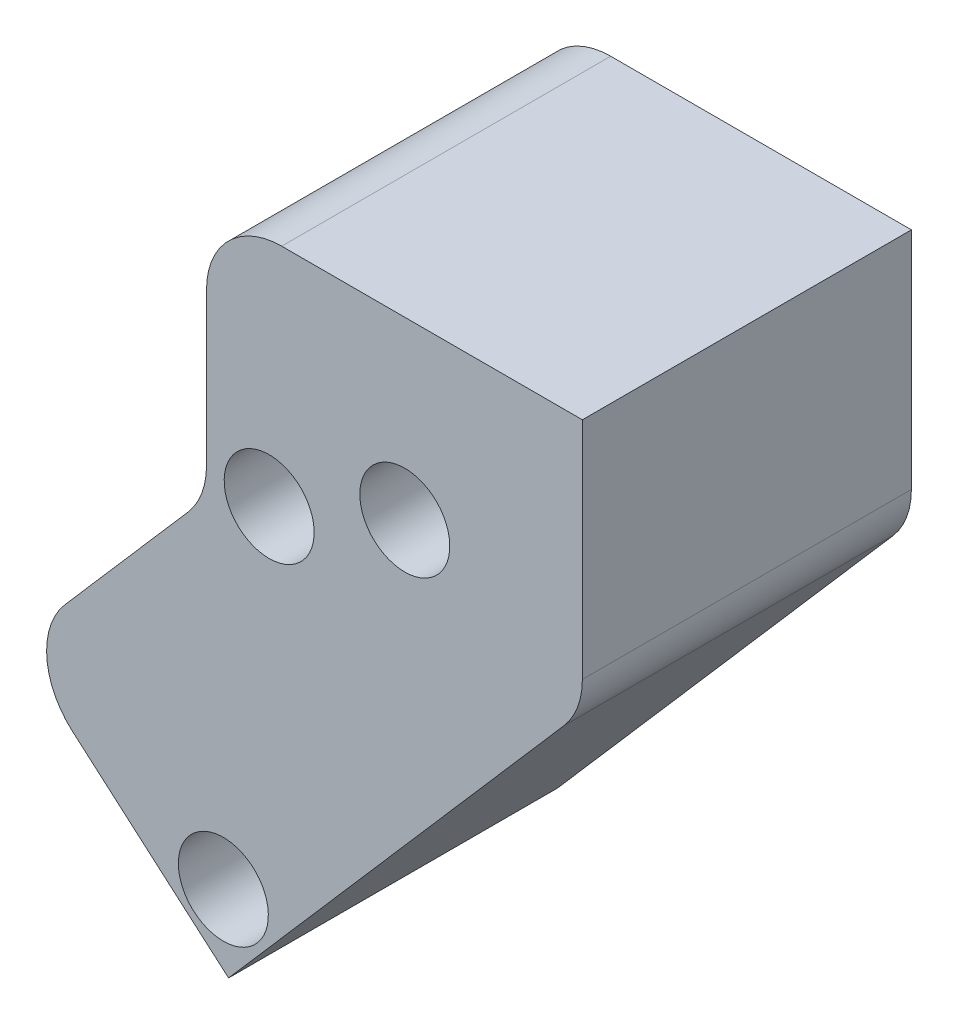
ISO-10303-21;
HEADER;
FILE_DESCRIPTION(('STEP AP214'),'2;1');
FILE_NAME('part.step','',(''),(''),'','','');
FILE_SCHEMA(('AUTOMOTIVE_DESIGN { 1 0 10303 214 1 1 1 1 }'));
ENDSEC;
DATA;
#1=APPLICATION_CONTEXT('core data for automotive mechanical design processes');
#2=APPLICATION_PROTOCOL_DEFINITION('international standard','automotive_design',2000,#1);
#3=PRODUCT_CONTEXT('',#1,'mechanical');
#4=PRODUCT('Part','Part','',(#3));
#5=PRODUCT_RELATED_PRODUCT_CATEGORY('part','',(#4));
#6=PRODUCT_DEFINITION_FORMATION('','',#4);
#7=PRODUCT_DEFINITION_CONTEXT('part definition',#1,'design');
#8=PRODUCT_DEFINITION('design','',#6,#7);
#9=PRODUCT_DEFINITION_SHAPE('','',#8);
#10=(LENGTH_UNIT() NAMED_UNIT(*) SI_UNIT(.MILLI.,.METRE.));
#11=(NAMED_UNIT(*) PLANE_ANGLE_UNIT() SI_UNIT($,.RADIAN.));
#12=(NAMED_UNIT(*) SI_UNIT($,.STERADIAN.) SOLID_ANGLE_UNIT());
#13=UNCERTAINTY_MEASURE_WITH_UNIT(LENGTH_MEASURE(1.E-05),#10,'distance_accuracy_value','');
#14=(GEOMETRIC_REPRESENTATION_CONTEXT(3) GLOBAL_UNCERTAINTY_ASSIGNED_CONTEXT((#13)) GLOBAL_UNIT_ASSIGNED_CONTEXT((#10,
#11,#12)) REPRESENTATION_CONTEXT('',''));
#15=CARTESIAN_POINT('',(0.,0.,0.));
#16=DIRECTION('',(0.,0.,1.));
#17=DIRECTION('',(1.,0.,0.));
#18=AXIS2_PLACEMENT_3D('',#15,#16,#17);
#19=CARTESIAN_POINT('',(-2.53446297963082E-11,8.21987336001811E-12,1.59986189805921));
#20=DIRECTION('',(1.58417609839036E-11,-5.13786431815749E-12,-1.));
#21=DIRECTION('',(-1.,0.,-1.58417609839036E-11));
#22=AXIS2_PLACEMENT_3D('',#19,#20,#21);
#23=PLANE('',#22);
#24=CARTESIAN_POINT('',(-695.325000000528,-36.6948728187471,1.59986188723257));
#25=DIRECTION('',(0.,5.13786431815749E-12,1.));
#26=DIRECTION('',(0.,-1.,5.13786431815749E-12));
#27=AXIS2_PLACEMENT_3D('',#24,#25,#26);
#28=CIRCLE('',#27,4.55930000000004);
#29=CARTESIAN_POINT('',(-695.325000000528,-41.2541728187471,1.59986188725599));
#30=VERTEX_POINT('',#29);
#31=EDGE_CURVE('E299',#30,#30,#28,.T.);
#32=ORIENTED_EDGE('',*,*,#31,.F.);
#33=EDGE_LOOP('',(#32));
#34=FACE_BOUND('',#33,.T.);
#35=CARTESIAN_POINT('',(-681.576795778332,-31.0085922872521,1.59986188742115));
#36=DIRECTION('',(0.,5.13786431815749E-12,1.));
#37=DIRECTION('',(0.,-1.,5.13786431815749E-12));
#38=AXIS2_PLACEMENT_3D('',#35,#36,#37);
#39=CIRCLE('',#38,4.55930000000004);
#40=CARTESIAN_POINT('',(-681.576795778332,-35.5678922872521,1.59986188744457));
#41=VERTEX_POINT('',#40);
#42=EDGE_CURVE('E283',#41,#41,#39,.T.);
#43=ORIENTED_EDGE('',*,*,#42,.F.);
#44=EDGE_LOOP('',(#43));
#45=FACE_BOUND('',#44,.T.);
#46=CARTESIAN_POINT('',(-699.969677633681,-72.610364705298,1.59986188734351));
#47=DIRECTION('',(0.,5.13786431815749E-12,1.));
#48=DIRECTION('',(0.,-1.,5.13786431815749E-12));
#49=AXIS2_PLACEMENT_3D('',#46,#47,#48);
#50=CIRCLE('',#49,4.55930000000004);
#51=CARTESIAN_POINT('',(-699.969677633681,-77.169664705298,1.59986188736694));
#52=VERTEX_POINT('',#51);
#53=EDGE_CURVE('E267',#52,#52,#50,.T.);
#54=ORIENTED_EDGE('',*,*,#53,.F.);
#55=EDGE_LOOP('',(#54));
#56=FACE_BOUND('',#55,.T.);
#57=DIRECTION('',(1.,0.,1.58417609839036E-11));
#58=VECTOR('',#57,1.);
#59=CARTESIAN_POINT('',(-663.574999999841,-13.1998728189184,1.59986188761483));
#60=LINE('',#59,#58);
#61=CARTESIAN_POINT('',(-694.055,-13.1998728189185,1.59986188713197));
#62=VERTEX_POINT('',#61);
#63=CARTESIAN_POINT('',(-663.575,-13.1998728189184,1.59986188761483));
#64=VERTEX_POINT('',#63);
#65=EDGE_CURVE('E124',#62,#64,#60,.T.);
#66=ORIENTED_EDGE('',*,*,#65,.F.);
#67=CARTESIAN_POINT('',(-694.055,-20.8198728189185,1.59986188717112));
#68=DIRECTION('',(1.58417609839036E-11,-5.13786431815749E-12,-1.));
#69=DIRECTION('',(-1.,0.,-1.58417609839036E-11));
#70=AXIS2_PLACEMENT_3D('',#67,#68,#69);
#71=CIRCLE('',#70,7.61999999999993);
#72=CARTESIAN_POINT('',(-701.675,-20.8198728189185,1.59986188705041));
#73=VERTEX_POINT('',#72);
#74=EDGE_CURVE('E131',#73,#62,#71,.T.);
#75=ORIENTED_EDGE('',*,*,#74,.F.);
#76=DIRECTION('',(0.,1.,-5.13786431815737E-12));
#77=VECTOR('',#76,1.);
#78=CARTESIAN_POINT('',(-701.675,-20.8198728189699,1.59986188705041));
#79=LINE('',#78,#77);
#80=CARTESIAN_POINT('',(-701.675,-36.2820751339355,1.59986188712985));
#81=VERTEX_POINT('',#80);
#82=EDGE_CURVE('E248',#81,#73,#79,.T.);
#83=ORIENTED_EDGE('',*,*,#82,.F.);
#84=CARTESIAN_POINT('',(-709.295,-36.2820751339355,1.59986188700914));
#85=DIRECTION('',(1.58417609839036E-11,-5.13786431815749E-12,-1.));
#86=DIRECTION('',(-1.,0.,-1.58417609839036E-11));
#87=AXIS2_PLACEMENT_3D('',#84,#85,#86);
#88=CIRCLE('',#87,7.61999999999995);
#89=CARTESIAN_POINT('',(-703.541670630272,-41.2784339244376,1.59986188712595));
#90=VERTEX_POINT('',#89);
#91=EDGE_CURVE('E244',#90,#81,#88,.F.);
#92=ORIENTED_EDGE('',*,*,#91,.F.);
#93=DIRECTION('',(0.65569012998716,0.75503010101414,6.50804410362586E-12));
#94=VECTOR('',#93,1.);
#95=CARTESIAN_POINT('',(-703.54167063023,-41.2784339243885,1.59986188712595));
#96=LINE('',#95,#94);
#97=CARTESIAN_POINT('',(-716.018424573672,-55.6454715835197,1.59986188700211));
#98=VERTEX_POINT('',#97);
#99=EDGE_CURVE('E239',#98,#90,#96,.T.);
#100=ORIENTED_EDGE('',*,*,#99,.F.);
#101=CARTESIAN_POINT('',(-710.265095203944,-60.6418303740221,1.59986188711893));
#102=DIRECTION('',(1.58417609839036E-11,-5.13786431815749E-12,-1.));
#103=DIRECTION('',(-1.,0.,-1.58417609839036E-11));
#104=AXIS2_PLACEMENT_3D('',#101,#102,#103);
#105=CIRCLE('',#104,7.62000000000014);
#106=CARTESIAN_POINT('',(-715.261453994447,-66.3951597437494,1.59986188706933));
#107=VERTEX_POINT('',#106);
#108=EDGE_CURVE('E258',#107,#98,#105,.T.);
#109=ORIENTED_EDGE('',*,*,#108,.F.);
#110=DIRECTION('',(-0.75503010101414,0.65569012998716,-1.53298533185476E-11));
#111=VECTOR('',#110,1.);
#112=CARTESIAN_POINT('',(-715.261453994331,-66.39515974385,1.59986188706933));
#113=LINE('',#112,#111);
#114=CARTESIAN_POINT('',(-699.439798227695,-80.1351464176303,1.59986188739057));
#115=VERTEX_POINT('',#114);
#116=EDGE_CURVE('E229',#115,#107,#113,.T.);
#117=ORIENTED_EDGE('',*,*,#116,.F.);
#118=DIRECTION('',(-0.65569012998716,-0.75503010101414,-6.50804410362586E-12));
#119=VECTOR('',#118,1.);
#120=CARTESIAN_POINT('',(-665.441670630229,-40.9861512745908,1.59986188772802));
#121=LINE('',#120,#119);
#122=CARTESIAN_POINT('',(-665.441670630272,-40.9861512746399,1.59986188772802));
#123=VERTEX_POINT('',#122);
#124=EDGE_CURVE('E224',#123,#115,#121,.T.);
#125=ORIENTED_EDGE('',*,*,#124,.F.);
#126=CARTESIAN_POINT('',(-671.195,-35.989792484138,1.59986188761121));
#127=DIRECTION('',(1.58417609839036E-11,-5.13786431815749E-12,-1.));
#128=DIRECTION('',(-1.,0.,-1.58417609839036E-11));
#129=AXIS2_PLACEMENT_3D('',#126,#127,#128);
#130=CIRCLE('',#129,7.61999999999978);
#131=CARTESIAN_POINT('',(-663.575,-35.989792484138,1.59986188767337));
#132=VERTEX_POINT('',#131);
#133=EDGE_CURVE('E64',#132,#123,#130,.T.);
#134=ORIENTED_EDGE('',*,*,#133,.F.);
#135=DIRECTION('',(0.,-1.,5.13786431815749E-12));
#136=VECTOR('',#135,1.);
#137=CARTESIAN_POINT('',(-663.575,-13.1998728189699,1.59986188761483));
#138=LINE('',#137,#136);
#139=EDGE_CURVE('E12',#64,#132,#138,.T.);
#140=ORIENTED_EDGE('',*,*,#139,.F.);
#141=EDGE_LOOP('',(#66,#75,#83,#92,#100,#109,#117,#125,#134,#140));
#142=FACE_BOUND('',#141,.T.);
#143=ADVANCED_FACE('F48',(#34,#45,#56,#142),#23,.F.);
#144=CARTESIAN_POINT('',(-663.575,-13.1998728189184,11.6078));
#145=DIRECTION('',(0.,-1.,0.));
#146=DIRECTION('',(1.,0.,0.));
#147=AXIS2_PLACEMENT_3D('',#144,#145,#146);
#148=PLANE('',#147);
#149=DIRECTION('',(0.,0.,-1.));
#150=VECTOR('',#149,1.);
#151=CARTESIAN_POINT('',(-694.055,-13.1998728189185,11.6078));
#152=LINE('',#151,#150);
#153=CARTESIAN_POINT('',(-694.055,-13.1998728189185,-31.75));
#154=VERTEX_POINT('',#153);
#155=EDGE_CURVE('E57',#62,#154,#152,.T.);
#156=ORIENTED_EDGE('',*,*,#155,.F.);
#157=ORIENTED_EDGE('',*,*,#65,.T.);
#158=DIRECTION('',(0.,0.,-1.));
#159=VECTOR('',#158,1.);
#160=CARTESIAN_POINT('',(-663.575,-13.1998728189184,11.6078));
#161=LINE('',#160,#159);
#162=CARTESIAN_POINT('',(-663.575,-13.1998728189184,-31.75));
#163=VERTEX_POINT('',#162);
#164=EDGE_CURVE('E71',#64,#163,#161,.T.);
#165=ORIENTED_EDGE('',*,*,#164,.T.);
#166=DIRECTION('',(-1.,0.,0.));
#167=VECTOR('',#166,1.);
#168=CARTESIAN_POINT('',(-663.575,-13.1998728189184,-31.75));
#169=LINE('',#168,#167);
#170=EDGE_CURVE('E130',#163,#154,#169,.T.);
#171=ORIENTED_EDGE('',*,*,#170,.T.);
#172=EDGE_LOOP('',(#156,#157,#165,#171));
#173=FACE_BOUND('',#172,.T.);
#174=ADVANCED_FACE('F50',(#173),#148,.F.);
#175=CARTESIAN_POINT('',(-694.055,-20.8198728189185,11.6078));
#176=DIRECTION('',(0.,0.,-1.));
#177=DIRECTION('',(-1.,0.,0.));
#178=AXIS2_PLACEMENT_3D('',#175,#176,#177);
#179=CYLINDRICAL_SURFACE('',#178,7.61999999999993);
#180=DIRECTION('',(0.,0.,-1.));
#181=VECTOR('',#180,1.);
#182=CARTESIAN_POINT('',(-701.675,-20.8198728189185,11.6078));
#183=LINE('',#182,#181);
#184=CARTESIAN_POINT('',(-701.675,-20.8198728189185,-31.75));
#185=VERTEX_POINT('',#184);
#186=EDGE_CURVE('E166',#73,#185,#183,.T.);
#187=ORIENTED_EDGE('',*,*,#186,.F.);
#188=ORIENTED_EDGE('',*,*,#74,.T.);
#189=ORIENTED_EDGE('',*,*,#155,.T.);
#190=CARTESIAN_POINT('',(-694.055,-20.8198728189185,-31.75));
#191=DIRECTION('',(0.,0.,1.));
#192=DIRECTION('',(1.,0.,0.));
#193=AXIS2_PLACEMENT_3D('',#190,#191,#192);
#194=CIRCLE('',#193,7.61999999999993);
#195=EDGE_CURVE('E175',#154,#185,#194,.T.);
#196=ORIENTED_EDGE('',*,*,#195,.T.);
#197=EDGE_LOOP('',(#187,#188,#189,#196));
#198=FACE_BOUND('',#197,.T.);
#199=ADVANCED_FACE('F174',(#198),#179,.T.);
#200=CARTESIAN_POINT('',(-701.675,-20.8198728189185,11.6078));
#201=DIRECTION('',(1.,0.,0.));
#202=DIRECTION('',(0.,1.,0.));
#203=AXIS2_PLACEMENT_3D('',#200,#201,#202);
#204=PLANE('',#203);
#205=DIRECTION('',(0.,0.,-1.));
#206=VECTOR('',#205,1.);
#207=CARTESIAN_POINT('',(-701.675,-36.2820751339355,11.6078));
#208=LINE('',#207,#206);
#209=CARTESIAN_POINT('',(-701.675,-36.2820751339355,-31.75));
#210=VERTEX_POINT('',#209);
#211=EDGE_CURVE('E163',#81,#210,#208,.T.);
#212=ORIENTED_EDGE('',*,*,#211,.F.);
#213=ORIENTED_EDGE('',*,*,#82,.T.);
#214=ORIENTED_EDGE('',*,*,#186,.T.);
#215=DIRECTION('',(0.,-1.,0.));
#216=VECTOR('',#215,1.);
#217=CARTESIAN_POINT('',(-701.675,-20.8198728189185,-31.75));
#218=LINE('',#217,#216);
#219=EDGE_CURVE('E181',#185,#210,#218,.T.);
#220=ORIENTED_EDGE('',*,*,#219,.T.);
#221=EDGE_LOOP('',(#212,#213,#214,#220));
#222=FACE_BOUND('',#221,.T.);
#223=ADVANCED_FACE('F247',(#222),#204,.F.);
#224=CARTESIAN_POINT('',(-709.295,-36.2820751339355,11.6078));
#225=DIRECTION('',(0.,0.,-1.));
#226=DIRECTION('',(-1.,0.,0.));
#227=AXIS2_PLACEMENT_3D('',#224,#225,#226);
#228=CYLINDRICAL_SURFACE('',#227,7.61999999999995);
#229=DIRECTION('',(0.,0.,-1.));
#230=VECTOR('',#229,1.);
#231=CARTESIAN_POINT('',(-703.541670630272,-41.2784339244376,11.6078));
#232=LINE('',#231,#230);
#233=CARTESIAN_POINT('',(-703.541670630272,-41.2784339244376,-31.75));
#234=VERTEX_POINT('',#233);
#235=EDGE_CURVE('E160',#90,#234,#232,.T.);
#236=ORIENTED_EDGE('',*,*,#235,.F.);
#237=ORIENTED_EDGE('',*,*,#91,.T.);
#238=ORIENTED_EDGE('',*,*,#211,.T.);
#239=CARTESIAN_POINT('',(-709.295,-36.2820751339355,-31.75));
#240=DIRECTION('',(0.,0.,-1.));
#241=DIRECTION('',(-1.,0.,0.));
#242=AXIS2_PLACEMENT_3D('',#239,#240,#241);
#243=CIRCLE('',#242,7.61999999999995);
#244=EDGE_CURVE('E191',#210,#234,#243,.T.);
#245=ORIENTED_EDGE('',*,*,#244,.T.);
#246=EDGE_LOOP('',(#236,#237,#238,#245));
#247=FACE_BOUND('',#246,.T.);
#248=ADVANCED_FACE('F242',(#247),#228,.F.);
#249=CARTESIAN_POINT('',(-703.541670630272,-41.2784339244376,11.6078));
#250=DIRECTION('',(0.75503010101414,-0.655690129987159,0.));
#251=DIRECTION('',(0.65569012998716,0.75503010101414,0.));
#252=AXIS2_PLACEMENT_3D('',#249,#250,#251);
#253=PLANE('',#252);
#254=DIRECTION('',(0.,0.,-1.));
#255=VECTOR('',#254,1.);
#256=CARTESIAN_POINT('',(-716.018424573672,-55.6454715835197,11.6078));
#257=LINE('',#256,#255);
#258=CARTESIAN_POINT('',(-716.018424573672,-55.6454715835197,-31.75));
#259=VERTEX_POINT('',#258);
#260=EDGE_CURVE('E157',#98,#259,#257,.T.);
#261=ORIENTED_EDGE('',*,*,#260,.F.);
#262=ORIENTED_EDGE('',*,*,#99,.T.);
#263=ORIENTED_EDGE('',*,*,#235,.T.);
#264=DIRECTION('',(-0.655690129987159,-0.75503010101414,0.));
#265=VECTOR('',#264,1.);
#266=CARTESIAN_POINT('',(-703.541670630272,-41.2784339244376,-31.75));
#267=LINE('',#266,#265);
#268=EDGE_CURVE('E195',#234,#259,#267,.T.);
#269=ORIENTED_EDGE('',*,*,#268,.T.);
#270=EDGE_LOOP('',(#261,#262,#263,#269));
#271=FACE_BOUND('',#270,.T.);
#272=ADVANCED_FACE('F236',(#271),#253,.F.);
#273=CARTESIAN_POINT('',(-710.265095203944,-60.6418303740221,11.6078));
#274=DIRECTION('',(0.,0.,-1.));
#275=DIRECTION('',(-1.,0.,0.));
#276=AXIS2_PLACEMENT_3D('',#273,#274,#275);
#277=CYLINDRICAL_SURFACE('',#276,7.62000000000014);
#278=DIRECTION('',(0.,0.,-1.));
#279=VECTOR('',#278,1.);
#280=CARTESIAN_POINT('',(-715.261453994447,-66.3951597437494,11.6078));
#281=LINE('',#280,#279);
#282=CARTESIAN_POINT('',(-715.261453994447,-66.3951597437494,-31.75));
#283=VERTEX_POINT('',#282);
#284=EDGE_CURVE('E154',#107,#283,#281,.T.);
#285=ORIENTED_EDGE('',*,*,#284,.F.);
#286=ORIENTED_EDGE('',*,*,#108,.T.);
#287=ORIENTED_EDGE('',*,*,#260,.T.);
#288=CARTESIAN_POINT('',(-710.265095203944,-60.6418303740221,-31.75));
#289=DIRECTION('',(0.,0.,1.));
#290=DIRECTION('',(-1.,0.,0.));
#291=AXIS2_PLACEMENT_3D('',#288,#289,#290);
#292=CIRCLE('',#291,7.62000000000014);
#293=EDGE_CURVE('E199',#259,#283,#292,.T.);
#294=ORIENTED_EDGE('',*,*,#293,.T.);
#295=EDGE_LOOP('',(#285,#286,#287,#294));
#296=FACE_BOUND('',#295,.T.);
#297=ADVANCED_FACE('F232',(#296),#277,.T.);
#298=CARTESIAN_POINT('',(-715.261453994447,-66.3951597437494,11.6078));
#299=DIRECTION('',(0.655690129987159,0.75503010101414,0.));
#300=DIRECTION('',(-0.75503010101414,0.65569012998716,0.));
#301=AXIS2_PLACEMENT_3D('',#298,#299,#300);
#302=PLANE('',#301);
#303=DIRECTION('',(0.,0.,-1.));
#304=VECTOR('',#303,1.);
#305=CARTESIAN_POINT('',(-699.439798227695,-80.1351464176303,11.6078));
#306=LINE('',#305,#304);
#307=CARTESIAN_POINT('',(-699.439798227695,-80.1351464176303,-31.75));
#308=VERTEX_POINT('',#307);
#309=EDGE_CURVE('E151',#115,#308,#306,.T.);
#310=ORIENTED_EDGE('',*,*,#309,.F.);
#311=ORIENTED_EDGE('',*,*,#116,.T.);
#312=ORIENTED_EDGE('',*,*,#284,.T.);
#313=DIRECTION('',(0.75503010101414,-0.655690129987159,0.));
#314=VECTOR('',#313,1.);
#315=CARTESIAN_POINT('',(-715.261453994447,-66.3951597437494,-31.75));
#316=LINE('',#315,#314);
#317=EDGE_CURVE('E203',#283,#308,#316,.T.);
#318=ORIENTED_EDGE('',*,*,#317,.T.);
#319=EDGE_LOOP('',(#310,#311,#312,#318));
#320=FACE_BOUND('',#319,.T.);
#321=ADVANCED_FACE('F227',(#320),#302,.F.);
#322=CARTESIAN_POINT('',(-665.441670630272,-40.98615127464,11.6078));
#323=DIRECTION('',(-0.755030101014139,0.65569012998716,0.));
#324=DIRECTION('',(-0.65569012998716,-0.75503010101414,0.));
#325=AXIS2_PLACEMENT_3D('',#322,#323,#324);
#326=PLANE('',#325);
#327=DIRECTION('',(0.,0.,-1.));
#328=VECTOR('',#327,1.);
#329=CARTESIAN_POINT('',(-665.441670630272,-40.98615127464,11.6078));
#330=LINE('',#329,#328);
#331=CARTESIAN_POINT('',(-665.441670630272,-40.98615127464,-31.75));
#332=VERTEX_POINT('',#331);
#333=EDGE_CURVE('E143',#123,#332,#330,.T.);
#334=ORIENTED_EDGE('',*,*,#333,.F.);
#335=ORIENTED_EDGE('',*,*,#124,.T.);
#336=ORIENTED_EDGE('',*,*,#309,.T.);
#337=DIRECTION('',(0.65569012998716,0.755030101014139,0.));
#338=VECTOR('',#337,1.);
#339=CARTESIAN_POINT('',(-665.441670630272,-40.98615127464,-31.75));
#340=LINE('',#339,#338);
#341=EDGE_CURVE('E207',#308,#332,#340,.T.);
#342=ORIENTED_EDGE('',*,*,#341,.T.);
#343=EDGE_LOOP('',(#334,#335,#336,#342));
#344=FACE_BOUND('',#343,.T.);
#345=ADVANCED_FACE('F221',(#344),#326,.F.);
#346=CARTESIAN_POINT('',(-671.195,-35.989792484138,11.6078));
#347=DIRECTION('',(0.,0.,-1.));
#348=DIRECTION('',(-1.,0.,0.));
#349=AXIS2_PLACEMENT_3D('',#346,#347,#348);
#350=CYLINDRICAL_SURFACE('',#349,7.61999999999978);
#351=DIRECTION('',(0.,0.,-1.));
#352=VECTOR('',#351,1.);
#353=CARTESIAN_POINT('',(-663.575,-35.989792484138,11.6078));
#354=LINE('',#353,#352);
#355=CARTESIAN_POINT('',(-663.575,-35.989792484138,-31.75));
#356=VERTEX_POINT('',#355);
#357=EDGE_CURVE('E138',#132,#356,#354,.T.);
#358=ORIENTED_EDGE('',*,*,#357,.F.);
#359=ORIENTED_EDGE('',*,*,#133,.T.);
#360=ORIENTED_EDGE('',*,*,#333,.T.);
#361=CARTESIAN_POINT('',(-671.195,-35.989792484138,-31.75));
#362=DIRECTION('',(0.,0.,1.));
#363=DIRECTION('',(1.,0.,0.));
#364=AXIS2_PLACEMENT_3D('',#361,#362,#363);
#365=CIRCLE('',#364,7.61999999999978);
#366=EDGE_CURVE('E145',#332,#356,#365,.T.);
#367=ORIENTED_EDGE('',*,*,#366,.T.);
#368=EDGE_LOOP('',(#358,#359,#360,#367));
#369=FACE_BOUND('',#368,.T.);
#370=ADVANCED_FACE('F215',(#369),#350,.T.);
#371=CARTESIAN_POINT('',(-663.575,-13.1998728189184,11.6078));
#372=DIRECTION('',(-1.,0.,0.));
#373=DIRECTION('',(0.,0.,1.));
#374=AXIS2_PLACEMENT_3D('',#371,#372,#373);
#375=PLANE('',#374);
#376=ORIENTED_EDGE('',*,*,#164,.F.);
#377=ORIENTED_EDGE('',*,*,#139,.T.);
#378=ORIENTED_EDGE('',*,*,#357,.T.);
#379=DIRECTION('',(0.,1.,0.));
#380=VECTOR('',#379,1.);
#381=CARTESIAN_POINT('',(-663.575,-13.1998728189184,-31.75));
#382=LINE('',#381,#380);
#383=EDGE_CURVE('E135',#356,#163,#382,.T.);
#384=ORIENTED_EDGE('',*,*,#383,.T.);
#385=EDGE_LOOP('',(#376,#377,#378,#384));
#386=FACE_BOUND('',#385,.T.);
#387=ADVANCED_FACE('F133',(#386),#375,.F.);
#388=CARTESIAN_POINT('',(-694.055,-20.8198728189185,-31.75));
#389=DIRECTION('',(0.,0.,1.));
#390=DIRECTION('',(1.,0.,0.));
#391=AXIS2_PLACEMENT_3D('',#388,#389,#390);
#392=PLANE('',#391);
#393=CARTESIAN_POINT('',(-695.325000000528,-36.6948728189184,-31.7500000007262));
#394=DIRECTION('',(0.,5.13786431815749E-12,1.));
#395=DIRECTION('',(0.,-1.,5.13786431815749E-12));
#396=AXIS2_PLACEMENT_3D('',#393,#394,#395);
#397=CIRCLE('',#396,2.80669999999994);
#398=CARTESIAN_POINT('',(-695.325000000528,-39.5015728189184,-31.7500000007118));
#399=VERTEX_POINT('',#398);
#400=EDGE_CURVE('E311',#399,#399,#397,.T.);
#401=ORIENTED_EDGE('',*,*,#400,.T.);
#402=EDGE_LOOP('',(#401));
#403=FACE_BOUND('',#402,.T.);
#404=CARTESIAN_POINT('',(-681.576795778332,-31.0085922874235,-31.7500000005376));
#405=DIRECTION('',(0.,5.13786431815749E-12,1.));
#406=DIRECTION('',(0.,-1.,5.13786431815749E-12));
#407=AXIS2_PLACEMENT_3D('',#404,#405,#406);
#408=CIRCLE('',#407,2.80669999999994);
#409=CARTESIAN_POINT('',(-681.576795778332,-33.8152922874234,-31.7500000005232));
#410=VERTEX_POINT('',#409);
#411=EDGE_CURVE('E295',#410,#410,#408,.T.);
#412=ORIENTED_EDGE('',*,*,#411,.T.);
#413=EDGE_LOOP('',(#412));
#414=FACE_BOUND('',#413,.T.);
#415=CARTESIAN_POINT('',(-699.969677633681,-72.6103647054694,-31.7500000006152));
#416=DIRECTION('',(0.,5.13786431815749E-12,1.));
#417=DIRECTION('',(0.,-1.,5.13786431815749E-12));
#418=AXIS2_PLACEMENT_3D('',#415,#416,#417);
#419=CIRCLE('',#418,2.80669999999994);
#420=CARTESIAN_POINT('',(-699.969677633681,-75.4170647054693,-31.7500000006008));
#421=VERTEX_POINT('',#420);
#422=EDGE_CURVE('E279',#421,#421,#419,.T.);
#423=ORIENTED_EDGE('',*,*,#422,.T.);
#424=EDGE_LOOP('',(#423));
#425=FACE_BOUND('',#424,.T.);
#426=ORIENTED_EDGE('',*,*,#170,.F.);
#427=ORIENTED_EDGE('',*,*,#383,.F.);
#428=ORIENTED_EDGE('',*,*,#366,.F.);
#429=ORIENTED_EDGE('',*,*,#341,.F.);
#430=ORIENTED_EDGE('',*,*,#317,.F.);
#431=ORIENTED_EDGE('',*,*,#293,.F.);
#432=ORIENTED_EDGE('',*,*,#268,.F.);
#433=ORIENTED_EDGE('',*,*,#244,.F.);
#434=ORIENTED_EDGE('',*,*,#219,.F.);
#435=ORIENTED_EDGE('',*,*,#195,.F.);
#436=EDGE_LOOP('',(#426,#427,#428,#429,#430,#431,#432,#433,#434,#435));
#437=FACE_BOUND('',#436,.T.);
#438=ADVANCED_FACE('F178',(#403,#414,#425,#437),#392,.F.);
#439=CARTESIAN_POINT('',(-699.969677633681,-72.610364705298,1.59986188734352));
#440=DIRECTION('',(0.,5.13786431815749E-12,1.));
#441=DIRECTION('',(0.,-1.,5.13786431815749E-12));
#442=AXIS2_PLACEMENT_3D('',#439,#440,#441);
#443=CYLINDRICAL_SURFACE('',#442,4.55930000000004);
#444=CARTESIAN_POINT('',(-699.969677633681,-72.6103647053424,-7.03613811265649));
#445=DIRECTION('',(0.,5.13786431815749E-12,1.));
#446=DIRECTION('',(0.,-1.,5.13786431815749E-12));
#447=AXIS2_PLACEMENT_3D('',#444,#445,#446);
#448=CIRCLE('',#447,4.55930000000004);
#449=CARTESIAN_POINT('',(-699.969677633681,-77.1696647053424,-7.03613811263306));
#450=VERTEX_POINT('',#449);
#451=EDGE_CURVE('E271',#450,#450,#448,.T.);
#452=ORIENTED_EDGE('',*,*,#451,.F.);
#453=EDGE_LOOP('',(#452));
#454=FACE_BOUND('',#453,.T.);
#455=ORIENTED_EDGE('',*,*,#53,.T.);
#456=EDGE_LOOP('',(#455));
#457=FACE_BOUND('',#456,.T.);
#458=ADVANCED_FACE('F345',(#454,#457),#443,.F.);
#459=CARTESIAN_POINT('',(-697.162977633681,-72.6103647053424,-7.03613811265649));
#460=DIRECTION('',(0.,-5.13786431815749E-12,-1.));
#461=DIRECTION('',(0.,1.,-5.13786431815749E-12));
#462=AXIS2_PLACEMENT_3D('',#459,#460,#461);
#463=PLANE('',#462);
#464=CARTESIAN_POINT('',(-699.969677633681,-72.6103647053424,-7.03613811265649));
#465=DIRECTION('',(0.,5.13786431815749E-12,1.));
#466=DIRECTION('',(0.,-1.,5.13786431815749E-12));
#467=AXIS2_PLACEMENT_3D('',#464,#465,#466);
#468=CIRCLE('',#467,2.80670000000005);
#469=CARTESIAN_POINT('',(-699.969677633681,-75.4170647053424,-7.03613811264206));
#470=VERTEX_POINT('',#469);
#471=EDGE_CURVE('E275',#470,#470,#468,.T.);
#472=ORIENTED_EDGE('',*,*,#471,.F.);
#473=EDGE_LOOP('',(#472));
#474=FACE_BOUND('',#473,.T.);
#475=ORIENTED_EDGE('',*,*,#451,.T.);
#476=EDGE_LOOP('',(#475));
#477=FACE_BOUND('',#476,.T.);
#478=ADVANCED_FACE('F347',(#474,#477),#463,.F.);
#479=CARTESIAN_POINT('',(-699.969677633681,-72.610364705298,1.59986188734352));
#480=DIRECTION('',(0.,5.13786431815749E-12,1.));
#481=DIRECTION('',(0.,-1.,5.13786431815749E-12));
#482=AXIS2_PLACEMENT_3D('',#479,#480,#481);
#483=CYLINDRICAL_SURFACE('',#482,2.8067);
#484=ORIENTED_EDGE('',*,*,#422,.F.);
#485=EDGE_LOOP('',(#484));
#486=FACE_BOUND('',#485,.T.);
#487=ORIENTED_EDGE('',*,*,#471,.T.);
#488=EDGE_LOOP('',(#487));
#489=FACE_BOUND('',#488,.T.);
#490=ADVANCED_FACE('F354',(#486,#489),#483,.F.);
#491=CARTESIAN_POINT('',(-681.576795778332,-31.0085922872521,1.59986188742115));
#492=DIRECTION('',(0.,5.13786431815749E-12,1.));
#493=DIRECTION('',(0.,-1.,5.13786431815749E-12));
#494=AXIS2_PLACEMENT_3D('',#491,#492,#493);
#495=CYLINDRICAL_SURFACE('',#494,4.55930000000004);
#496=CARTESIAN_POINT('',(-681.576795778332,-31.0085922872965,-7.03613811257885));
#497=DIRECTION('',(0.,5.13786431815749E-12,1.));
#498=DIRECTION('',(0.,-1.,5.13786431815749E-12));
#499=AXIS2_PLACEMENT_3D('',#496,#497,#498);
#500=CIRCLE('',#499,4.55930000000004);
#501=CARTESIAN_POINT('',(-681.576795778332,-35.5678922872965,-7.03613811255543));
#502=VERTEX_POINT('',#501);
#503=EDGE_CURVE('E287',#502,#502,#500,.T.);
#504=ORIENTED_EDGE('',*,*,#503,.F.);
#505=EDGE_LOOP('',(#504));
#506=FACE_BOUND('',#505,.T.);
#507=ORIENTED_EDGE('',*,*,#42,.T.);
#508=EDGE_LOOP('',(#507));
#509=FACE_BOUND('',#508,.T.);
#510=ADVANCED_FACE('F470',(#506,#509),#495,.F.);
#511=CARTESIAN_POINT('',(-678.770095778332,-31.0085922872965,-7.03613811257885));
#512=DIRECTION('',(0.,-5.13786431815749E-12,-1.));
#513=DIRECTION('',(0.,1.,-5.13786431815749E-12));
#514=AXIS2_PLACEMENT_3D('',#511,#512,#513);
#515=PLANE('',#514);
#516=CARTESIAN_POINT('',(-681.576795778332,-31.0085922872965,-7.03613811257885));
#517=DIRECTION('',(0.,5.13786431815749E-12,1.));
#518=DIRECTION('',(0.,-1.,5.13786431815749E-12));
#519=AXIS2_PLACEMENT_3D('',#516,#517,#518);
#520=CIRCLE('',#519,2.80670000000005);
#521=CARTESIAN_POINT('',(-681.576795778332,-33.8152922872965,-7.03613811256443));
#522=VERTEX_POINT('',#521);
#523=EDGE_CURVE('E291',#522,#522,#520,.T.);
#524=ORIENTED_EDGE('',*,*,#523,.F.);
#525=EDGE_LOOP('',(#524));
#526=FACE_BOUND('',#525,.T.);
#527=ORIENTED_EDGE('',*,*,#503,.T.);
#528=EDGE_LOOP('',(#527));
#529=FACE_BOUND('',#528,.T.);
#530=ADVANCED_FACE('F480',(#526,#529),#515,.F.);
#531=CARTESIAN_POINT('',(-681.576795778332,-31.0085922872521,1.59986188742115));
#532=DIRECTION('',(0.,5.13786431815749E-12,1.));
#533=DIRECTION('',(0.,-1.,5.13786431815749E-12));
#534=AXIS2_PLACEMENT_3D('',#531,#532,#533);
#535=CYLINDRICAL_SURFACE('',#534,2.8067);
#536=ORIENTED_EDGE('',*,*,#411,.F.);
#537=EDGE_LOOP('',(#536));
#538=FACE_BOUND('',#537,.T.);
#539=ORIENTED_EDGE('',*,*,#523,.T.);
#540=EDGE_LOOP('',(#539));
#541=FACE_BOUND('',#540,.T.);
#542=ADVANCED_FACE('F334',(#538,#541),#535,.F.);
#543=CARTESIAN_POINT('',(-695.325000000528,-36.6948728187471,1.59986188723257));
#544=DIRECTION('',(0.,5.13786431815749E-12,1.));
#545=DIRECTION('',(0.,-1.,5.13786431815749E-12));
#546=AXIS2_PLACEMENT_3D('',#543,#544,#545);
#547=CYLINDRICAL_SURFACE('',#546,4.55930000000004);
#548=CARTESIAN_POINT('',(-695.325000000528,-36.6948728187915,-7.03613811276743));
#549=DIRECTION('',(0.,5.13786431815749E-12,1.));
#550=DIRECTION('',(0.,-1.,5.13786431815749E-12));
#551=AXIS2_PLACEMENT_3D('',#548,#549,#550);
#552=CIRCLE('',#551,4.55930000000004);
#553=CARTESIAN_POINT('',(-695.325000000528,-41.2541728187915,-7.03613811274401));
#554=VERTEX_POINT('',#553);
#555=EDGE_CURVE('E303',#554,#554,#552,.T.);
#556=ORIENTED_EDGE('',*,*,#555,.F.);
#557=EDGE_LOOP('',(#556));
#558=FACE_BOUND('',#557,.T.);
#559=ORIENTED_EDGE('',*,*,#31,.T.);
#560=EDGE_LOOP('',(#559));
#561=FACE_BOUND('',#560,.T.);
#562=ADVANCED_FACE('F328',(#558,#561),#547,.F.);
#563=CARTESIAN_POINT('',(-692.518300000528,-36.6948728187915,-7.03613811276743));
#564=DIRECTION('',(0.,-5.13786431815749E-12,-1.));
#565=DIRECTION('',(0.,1.,-5.13786431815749E-12));
#566=AXIS2_PLACEMENT_3D('',#563,#564,#565);
#567=PLANE('',#566);
#568=CARTESIAN_POINT('',(-695.325000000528,-36.6948728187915,-7.03613811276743));
#569=DIRECTION('',(0.,5.13786431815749E-12,1.));
#570=DIRECTION('',(0.,-1.,5.13786431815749E-12));
#571=AXIS2_PLACEMENT_3D('',#568,#569,#570);
#572=CIRCLE('',#571,2.80670000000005);
#573=CARTESIAN_POINT('',(-695.325000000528,-39.5015728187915,-7.03613811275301));
#574=VERTEX_POINT('',#573);
#575=EDGE_CURVE('E307',#574,#574,#572,.T.);
#576=ORIENTED_EDGE('',*,*,#575,.F.);
#577=EDGE_LOOP('',(#576));
#578=FACE_BOUND('',#577,.T.);
#579=ORIENTED_EDGE('',*,*,#555,.T.);
#580=EDGE_LOOP('',(#579));
#581=FACE_BOUND('',#580,.T.);
#582=ADVANCED_FACE('F322',(#578,#581),#567,.F.);
#583=CARTESIAN_POINT('',(-695.325000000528,-36.6948728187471,1.59986188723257));
#584=DIRECTION('',(0.,5.13786431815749E-12,1.));
#585=DIRECTION('',(0.,-1.,5.13786431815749E-12));
#586=AXIS2_PLACEMENT_3D('',#583,#584,#585);
#587=CYLINDRICAL_SURFACE('',#586,2.8067);
#588=ORIENTED_EDGE('',*,*,#400,.F.);
#589=EDGE_LOOP('',(#588));
#590=FACE_BOUND('',#589,.T.);
#591=ORIENTED_EDGE('',*,*,#575,.T.);
#592=EDGE_LOOP('',(#591));
#593=FACE_BOUND('',#592,.T.);
#594=ADVANCED_FACE('F319',(#590,#593),#587,.F.);
#595=CLOSED_SHELL('',(#143,#174,#199,#223,#248,#272,#297,#321,#345,#370,#387,#438,#458,#478,
#490,#510,#530,#542,#562,#582,#594));
#596=MANIFOLD_SOLID_BREP('B2',#595);
#597=ADVANCED_BREP_SHAPE_REPRESENTATION('',(#18,#596),#14);
#598=SHAPE_DEFINITION_REPRESENTATION(#9,#597);
ENDSEC;
END-ISO-10303-21;
